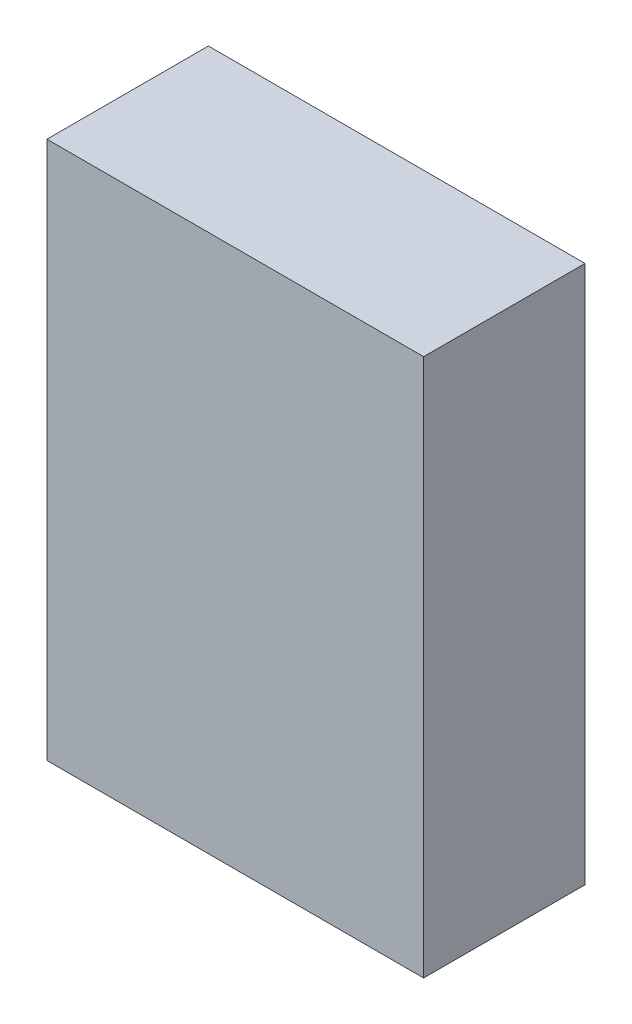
ISO-10303-21;
HEADER;
FILE_DESCRIPTION(('STEP AP214'),'2;1');
FILE_NAME('part.step','',(''),(''),'','','');
FILE_SCHEMA(('AUTOMOTIVE_DESIGN { 1 0 10303 214 1 1 1 1 }'));
ENDSEC;
DATA;
#1=APPLICATION_CONTEXT('core data for automotive mechanical design processes');
#2=APPLICATION_PROTOCOL_DEFINITION('international standard','automotive_design',2000,#1);
#3=PRODUCT_CONTEXT('',#1,'mechanical');
#4=PRODUCT('Part','Part','',(#3));
#5=PRODUCT_RELATED_PRODUCT_CATEGORY('part','',(#4));
#6=PRODUCT_DEFINITION_FORMATION('','',#4);
#7=PRODUCT_DEFINITION_CONTEXT('part definition',#1,'design');
#8=PRODUCT_DEFINITION('design','',#6,#7);
#9=PRODUCT_DEFINITION_SHAPE('','',#8);
#10=(LENGTH_UNIT() NAMED_UNIT(*) SI_UNIT(.MILLI.,.METRE.));
#11=(NAMED_UNIT(*) PLANE_ANGLE_UNIT() SI_UNIT($,.RADIAN.));
#12=(NAMED_UNIT(*) SI_UNIT($,.STERADIAN.) SOLID_ANGLE_UNIT());
#13=UNCERTAINTY_MEASURE_WITH_UNIT(LENGTH_MEASURE(1.E-05),#10,'distance_accuracy_value','');
#14=(GEOMETRIC_REPRESENTATION_CONTEXT(3) GLOBAL_UNCERTAINTY_ASSIGNED_CONTEXT((#13)) GLOBAL_UNIT_ASSIGNED_CONTEXT((#10,
#11,#12)) REPRESENTATION_CONTEXT('',''));
#15=CARTESIAN_POINT('',(0.,0.,0.));
#16=DIRECTION('',(0.,0.,1.));
#17=DIRECTION('',(1.,0.,0.));
#18=AXIS2_PLACEMENT_3D('',#15,#16,#17);
#19=CARTESIAN_POINT('',(44.45,127.,-19.05));
#20=DIRECTION('',(-1.,0.,0.));
#21=DIRECTION('',(0.,0.,1.));
#22=AXIS2_PLACEMENT_3D('',#19,#20,#21);
#23=PLANE('',#22);
#24=DIRECTION('',(0.,0.,-1.));
#25=VECTOR('',#24,1.);
#26=CARTESIAN_POINT('',(44.45,0.,-19.05));
#27=LINE('',#26,#25);
#28=CARTESIAN_POINT('',(44.45,0.,19.05));
#29=VERTEX_POINT('',#28);
#30=CARTESIAN_POINT('',(44.45,0.,-19.05));
#31=VERTEX_POINT('',#30);
#32=EDGE_CURVE('E95',#29,#31,#27,.T.);
#33=ORIENTED_EDGE('',*,*,#32,.T.);
#34=DIRECTION('',(0.,-1.,0.));
#35=VECTOR('',#34,1.);
#36=CARTESIAN_POINT('',(44.45,127.,-19.05));
#37=LINE('',#36,#35);
#38=CARTESIAN_POINT('',(44.45,127.,-19.05));
#39=VERTEX_POINT('',#38);
#40=EDGE_CURVE('E11',#39,#31,#37,.T.);
#41=ORIENTED_EDGE('',*,*,#40,.F.);
#42=DIRECTION('',(0.,0.,-1.));
#43=VECTOR('',#42,1.);
#44=CARTESIAN_POINT('',(44.45,127.,-19.05));
#45=LINE('',#44,#43);
#46=CARTESIAN_POINT('',(44.45,127.,19.05));
#47=VERTEX_POINT('',#46);
#48=EDGE_CURVE('E83',#47,#39,#45,.T.);
#49=ORIENTED_EDGE('',*,*,#48,.F.);
#50=DIRECTION('',(0.,-1.,0.));
#51=VECTOR('',#50,1.);
#52=CARTESIAN_POINT('',(44.45,127.,19.05));
#53=LINE('',#52,#51);
#54=EDGE_CURVE('E91',#47,#29,#53,.T.);
#55=ORIENTED_EDGE('',*,*,#54,.T.);
#56=EDGE_LOOP('',(#33,#41,#49,#55));
#57=FACE_BOUND('',#56,.T.);
#58=ADVANCED_FACE('F32',(#57),#23,.F.);
#59=CARTESIAN_POINT('',(-44.45,127.,-19.05));
#60=DIRECTION('',(0.,0.,1.));
#61=DIRECTION('',(1.,0.,0.));
#62=AXIS2_PLACEMENT_3D('',#59,#60,#61);
#63=PLANE('',#62);
#64=DIRECTION('',(-1.,0.,0.));
#65=VECTOR('',#64,1.);
#66=CARTESIAN_POINT('',(-44.45,0.,-19.05));
#67=LINE('',#66,#65);
#68=CARTESIAN_POINT('',(-44.45,0.,-19.05));
#69=VERTEX_POINT('',#68);
#70=EDGE_CURVE('E87',#31,#69,#67,.T.);
#71=ORIENTED_EDGE('',*,*,#70,.T.);
#72=DIRECTION('',(0.,-1.,0.));
#73=VECTOR('',#72,1.);
#74=CARTESIAN_POINT('',(-44.45,127.,-19.05));
#75=LINE('',#74,#73);
#76=CARTESIAN_POINT('',(-44.45,127.,-19.05));
#77=VERTEX_POINT('',#76);
#78=EDGE_CURVE('E40',#77,#69,#75,.T.);
#79=ORIENTED_EDGE('',*,*,#78,.F.);
#80=DIRECTION('',(-1.,0.,0.));
#81=VECTOR('',#80,1.);
#82=CARTESIAN_POINT('',(-44.45,127.,-19.05));
#83=LINE('',#82,#81);
#84=EDGE_CURVE('E78',#39,#77,#83,.T.);
#85=ORIENTED_EDGE('',*,*,#84,.F.);
#86=ORIENTED_EDGE('',*,*,#40,.T.);
#87=EDGE_LOOP('',(#71,#79,#85,#86));
#88=FACE_BOUND('',#87,.T.);
#89=ADVANCED_FACE('F86',(#88),#63,.F.);
#90=CARTESIAN_POINT('',(-44.45,127.,-19.05));
#91=DIRECTION('',(1.,0.,0.));
#92=DIRECTION('',(0.,0.,-1.));
#93=AXIS2_PLACEMENT_3D('',#90,#91,#92);
#94=PLANE('',#93);
#95=DIRECTION('',(0.,0.,1.));
#96=VECTOR('',#95,1.);
#97=CARTESIAN_POINT('',(-44.45,0.,-19.05));
#98=LINE('',#97,#96);
#99=CARTESIAN_POINT('',(-44.45,0.,19.05));
#100=VERTEX_POINT('',#99);
#101=EDGE_CURVE('E65',#69,#100,#98,.T.);
#102=ORIENTED_EDGE('',*,*,#101,.T.);
#103=DIRECTION('',(0.,-1.,0.));
#104=VECTOR('',#103,1.);
#105=CARTESIAN_POINT('',(-44.45,127.,19.05));
#106=LINE('',#105,#104);
#107=CARTESIAN_POINT('',(-44.45,127.,19.05));
#108=VERTEX_POINT('',#107);
#109=EDGE_CURVE('E88',#108,#100,#106,.T.);
#110=ORIENTED_EDGE('',*,*,#109,.F.);
#111=DIRECTION('',(0.,0.,1.));
#112=VECTOR('',#111,1.);
#113=CARTESIAN_POINT('',(-44.45,127.,-19.05));
#114=LINE('',#113,#112);
#115=EDGE_CURVE('E81',#77,#108,#114,.T.);
#116=ORIENTED_EDGE('',*,*,#115,.F.);
#117=ORIENTED_EDGE('',*,*,#78,.T.);
#118=EDGE_LOOP('',(#102,#110,#116,#117));
#119=FACE_BOUND('',#118,.T.);
#120=ADVANCED_FACE('F89',(#119),#94,.F.);
#121=CARTESIAN_POINT('',(-44.45,127.,19.05));
#122=DIRECTION('',(0.,0.,-1.));
#123=DIRECTION('',(-1.,0.,0.));
#124=AXIS2_PLACEMENT_3D('',#121,#122,#123);
#125=PLANE('',#124);
#126=DIRECTION('',(1.,0.,0.));
#127=VECTOR('',#126,1.);
#128=CARTESIAN_POINT('',(-44.45,0.,19.05));
#129=LINE('',#128,#127);
#130=EDGE_CURVE('E71',#100,#29,#129,.T.);
#131=ORIENTED_EDGE('',*,*,#130,.T.);
#132=ORIENTED_EDGE('',*,*,#54,.F.);
#133=DIRECTION('',(1.,0.,0.));
#134=VECTOR('',#133,1.);
#135=CARTESIAN_POINT('',(-44.45,127.,19.05));
#136=LINE('',#135,#134);
#137=EDGE_CURVE('E48',#108,#47,#136,.T.);
#138=ORIENTED_EDGE('',*,*,#137,.F.);
#139=ORIENTED_EDGE('',*,*,#109,.T.);
#140=EDGE_LOOP('',(#131,#132,#138,#139));
#141=FACE_BOUND('',#140,.T.);
#142=ADVANCED_FACE('F102',(#141),#125,.F.);
#143=CARTESIAN_POINT('',(0.,127.,0.));
#144=DIRECTION('',(0.,1.,0.));
#145=DIRECTION('',(0.,0.,1.));
#146=AXIS2_PLACEMENT_3D('',#143,#144,#145);
#147=PLANE('',#146);
#148=ORIENTED_EDGE('',*,*,#48,.T.);
#149=ORIENTED_EDGE('',*,*,#84,.T.);
#150=ORIENTED_EDGE('',*,*,#115,.T.);
#151=ORIENTED_EDGE('',*,*,#137,.T.);
#152=EDGE_LOOP('',(#148,#149,#150,#151));
#153=FACE_BOUND('',#152,.T.);
#154=ADVANCED_FACE('F79',(#153),#147,.T.);
#155=CARTESIAN_POINT('',(0.,0.,0.));
#156=DIRECTION('',(0.,1.,0.));
#157=DIRECTION('',(0.,0.,1.));
#158=AXIS2_PLACEMENT_3D('',#155,#156,#157);
#159=PLANE('',#158);
#160=ORIENTED_EDGE('',*,*,#32,.F.);
#161=ORIENTED_EDGE('',*,*,#130,.F.);
#162=ORIENTED_EDGE('',*,*,#101,.F.);
#163=ORIENTED_EDGE('',*,*,#70,.F.);
#164=EDGE_LOOP('',(#160,#161,#162,#163));
#165=FACE_BOUND('',#164,.T.);
#166=ADVANCED_FACE('F105',(#165),#159,.F.);
#167=CLOSED_SHELL('',(#58,#89,#120,#142,#154,#166));
#168=MANIFOLD_SOLID_BREP('B2',#167);
#169=ADVANCED_BREP_SHAPE_REPRESENTATION('',(#18,#168),#14);
#170=SHAPE_DEFINITION_REPRESENTATION(#9,#169);
ENDSEC;
END-ISO-10303-21;
